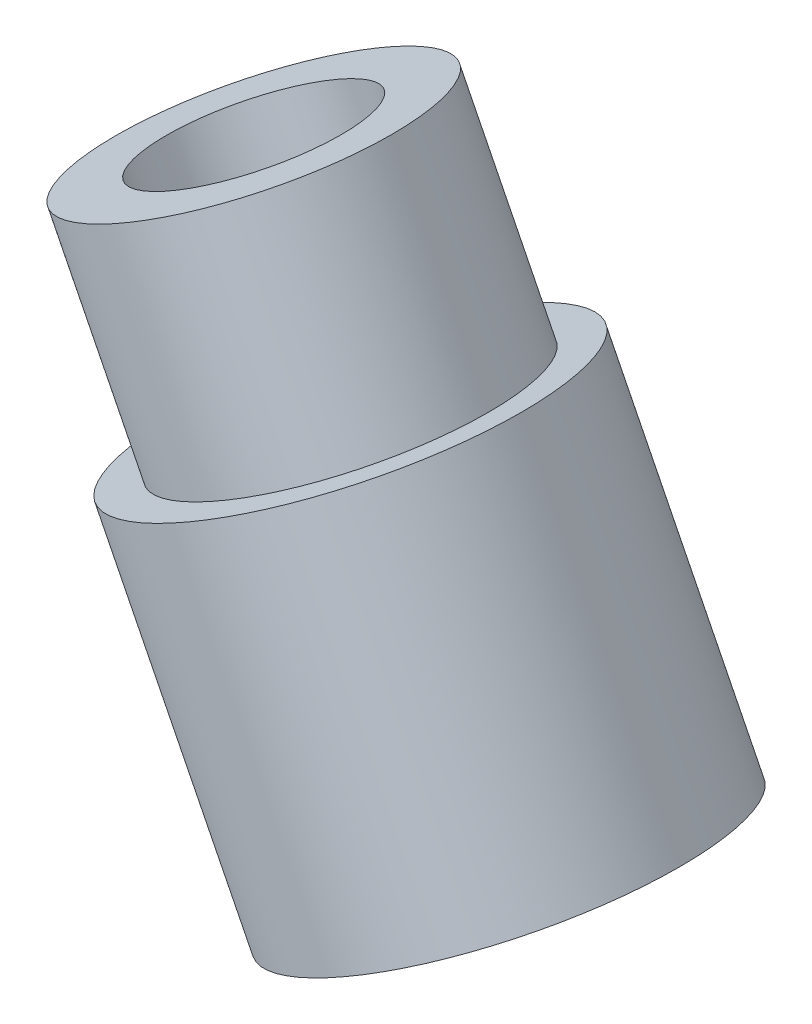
from build123d import *


with BuildPart() as part:
    # Esquisse1 → R_volution1 (revolve)
    with BuildSketch(Plane.XY):
        Polygon((8.749297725, 65.138594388), (10.885740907, 66.213281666), (6.841364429, 74.253369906), (5.994399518, 73.827324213), (3.522836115, 78.740711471), (2.233357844, 78.092069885), align=None)
    revolve(axis=Axis((11.413457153, 54.279052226, 0), (-0.44937516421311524, 0.8933431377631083, 0)))


solid = part.part
